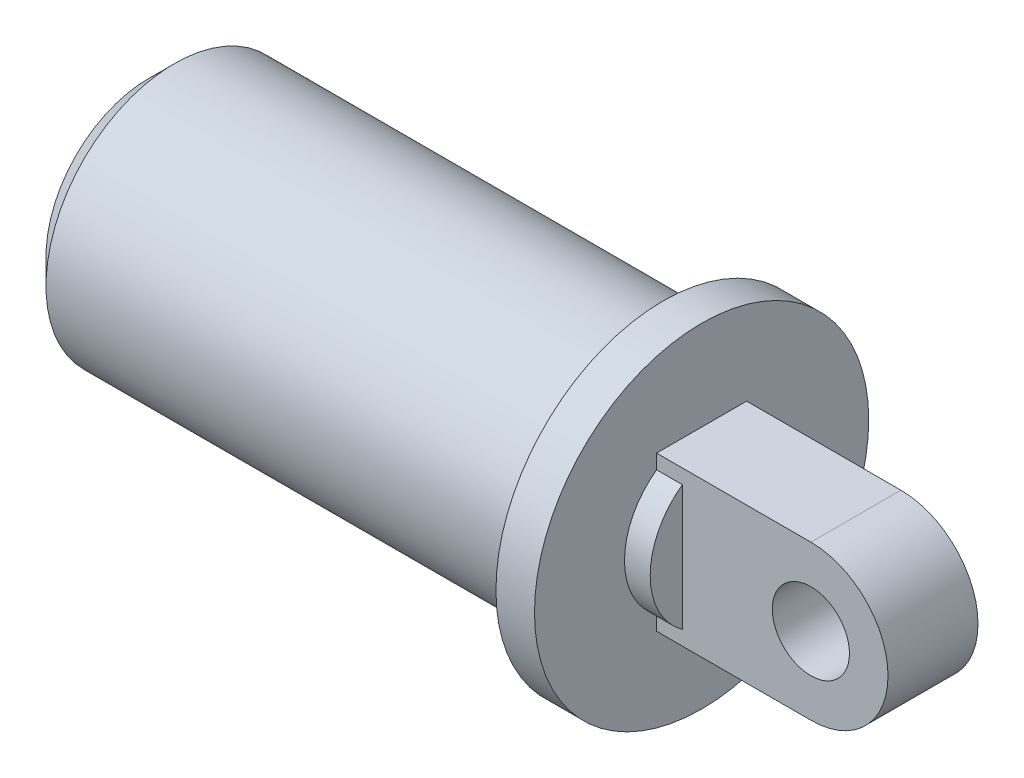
ISO-10303-21;
HEADER;
FILE_DESCRIPTION(('STEP AP214'),'2;1');
FILE_NAME('part.step','',(''),(''),'','','');
FILE_SCHEMA(('AUTOMOTIVE_DESIGN { 1 0 10303 214 1 1 1 1 }'));
ENDSEC;
DATA;
#1=APPLICATION_CONTEXT('core data for automotive mechanical design processes');
#2=APPLICATION_PROTOCOL_DEFINITION('international standard','automotive_design',2000,#1);
#3=PRODUCT_CONTEXT('',#1,'mechanical');
#4=PRODUCT('Part','Part','',(#3));
#5=PRODUCT_RELATED_PRODUCT_CATEGORY('part','',(#4));
#6=PRODUCT_DEFINITION_FORMATION('','',#4);
#7=PRODUCT_DEFINITION_CONTEXT('part definition',#1,'design');
#8=PRODUCT_DEFINITION('design','',#6,#7);
#9=PRODUCT_DEFINITION_SHAPE('','',#8);
#10=(LENGTH_UNIT() NAMED_UNIT(*) SI_UNIT(.MILLI.,.METRE.));
#11=(NAMED_UNIT(*) PLANE_ANGLE_UNIT() SI_UNIT($,.RADIAN.));
#12=(NAMED_UNIT(*) SI_UNIT($,.STERADIAN.) SOLID_ANGLE_UNIT());
#13=UNCERTAINTY_MEASURE_WITH_UNIT(LENGTH_MEASURE(1.E-05),#10,'distance_accuracy_value','');
#14=(GEOMETRIC_REPRESENTATION_CONTEXT(3) GLOBAL_UNCERTAINTY_ASSIGNED_CONTEXT((#13)) GLOBAL_UNIT_ASSIGNED_CONTEXT((#10,
#11,#12)) REPRESENTATION_CONTEXT('',''));
#15=CARTESIAN_POINT('',(0.,0.,0.));
#16=DIRECTION('',(0.,0.,1.));
#17=DIRECTION('',(1.,0.,0.));
#18=AXIS2_PLACEMENT_3D('',#15,#16,#17);
#19=CARTESIAN_POINT('',(0.,0.,-3.5));
#20=DIRECTION('',(0.,0.,1.));
#21=DIRECTION('',(1.,0.,0.));
#22=AXIS2_PLACEMENT_3D('',#19,#20,#21);
#23=CYLINDRICAL_SURFACE('',#22,3.);
#24=CARTESIAN_POINT('',(0.,0.,3.5));
#25=DIRECTION('',(0.,0.,1.));
#26=DIRECTION('',(1.,0.,0.));
#27=AXIS2_PLACEMENT_3D('',#24,#25,#26);
#28=CIRCLE('',#27,3.);
#29=CARTESIAN_POINT('',(3.,0.,3.5));
#30=VERTEX_POINT('',#29);
#31=EDGE_CURVE('E20',#30,#30,#28,.F.);
#32=ORIENTED_EDGE('',*,*,#31,.F.);
#33=EDGE_LOOP('',(#32));
#34=FACE_BOUND('',#33,.T.);
#35=CARTESIAN_POINT('',(0.,0.,-3.5));
#36=DIRECTION('',(0.,0.,1.));
#37=DIRECTION('',(1.,0.,0.));
#38=AXIS2_PLACEMENT_3D('',#35,#36,#37);
#39=CIRCLE('',#38,3.);
#40=CARTESIAN_POINT('',(3.,0.,-3.5));
#41=VERTEX_POINT('',#40);
#42=EDGE_CURVE('E155',#41,#41,#39,.F.);
#43=ORIENTED_EDGE('',*,*,#42,.T.);
#44=EDGE_LOOP('',(#43));
#45=FACE_BOUND('',#44,.T.);
#46=ADVANCED_FACE('F16',(#34,#45),#23,.F.);
#47=CARTESIAN_POINT('',(-25.,0.,0.));
#48=DIRECTION('',(1.,0.,0.));
#49=DIRECTION('',(0.,0.,-1.));
#50=AXIS2_PLACEMENT_3D('',#47,#48,#49);
#51=PLANE('',#50);
#52=CARTESIAN_POINT('',(-25.,0.,0.));
#53=DIRECTION('',(1.,0.,0.));
#54=DIRECTION('',(0.,0.,-1.));
#55=AXIS2_PLACEMENT_3D('',#52,#53,#54);
#56=CIRCLE('',#55,8.);
#57=CARTESIAN_POINT('',(-25.,0.,-8.));
#58=VERTEX_POINT('',#57);
#59=EDGE_CURVE('E103',#58,#58,#56,.F.);
#60=ORIENTED_EDGE('',*,*,#59,.T.);
#61=EDGE_LOOP('',(#60));
#62=FACE_BOUND('',#61,.T.);
#63=ADVANCED_FACE('F204',(#62),#51,.F.);
#64=CARTESIAN_POINT('',(-10.,0.,0.));
#65=DIRECTION('',(1.,0.,0.));
#66=DIRECTION('',(0.,0.,-1.));
#67=AXIS2_PLACEMENT_3D('',#64,#65,#66);
#68=PLANE('',#67);
#69=CARTESIAN_POINT('',(-10.,0.,0.));
#70=DIRECTION('',(1.,0.,0.));
#71=DIRECTION('',(0.,0.,-1.));
#72=AXIS2_PLACEMENT_3D('',#69,#70,#71);
#73=CIRCLE('',#72,6.);
#74=CARTESIAN_POINT('',(-10.,-4.8733971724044,3.50000000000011));
#75=VERTEX_POINT('',#74);
#76=CARTESIAN_POINT('',(-10.,4.8733971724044,3.50000000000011));
#77=VERTEX_POINT('',#76);
#78=EDGE_CURVE('E148',#75,#77,#73,.F.);
#79=ORIENTED_EDGE('',*,*,#78,.F.);
#80=DIRECTION('',(0.,1.,0.));
#81=VECTOR('',#80,1.);
#82=CARTESIAN_POINT('',(-10.,0.,3.5));
#83=LINE('',#82,#81);
#84=EDGE_CURVE('E106',#77,#75,#83,.F.);
#85=ORIENTED_EDGE('',*,*,#84,.F.);
#86=EDGE_LOOP('',(#79,#85));
#87=FACE_BOUND('',#86,.T.);
#88=ADVANCED_FACE('F231',(#87),#68,.T.);
#89=CARTESIAN_POINT('',(0.,0.,3.5));
#90=DIRECTION('',(0.,0.,1.));
#91=DIRECTION('',(1.,0.,0.));
#92=AXIS2_PLACEMENT_3D('',#89,#90,#91);
#93=PLANE('',#92);
#94=ORIENTED_EDGE('',*,*,#31,.T.);
#95=EDGE_LOOP('',(#94));
#96=FACE_BOUND('',#95,.T.);
#97=DIRECTION('',(1.,0.,0.));
#98=VECTOR('',#97,1.);
#99=CARTESIAN_POINT('',(-12.,4.87339717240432,3.50000000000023));
#100=LINE('',#99,#98);
#101=CARTESIAN_POINT('',(-12.,4.8733971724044,3.50000000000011));
#102=VERTEX_POINT('',#101);
#103=EDGE_CURVE('E97',#77,#102,#100,.F.);
#104=ORIENTED_EDGE('',*,*,#103,.F.);
#105=ORIENTED_EDGE('',*,*,#84,.T.);
#106=DIRECTION('',(1.,0.,0.));
#107=VECTOR('',#106,1.);
#108=CARTESIAN_POINT('',(-12.,-4.87339717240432,3.50000000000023));
#109=LINE('',#108,#107);
#110=CARTESIAN_POINT('',(-12.,-4.8733971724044,3.50000000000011));
#111=VERTEX_POINT('',#110);
#112=EDGE_CURVE('E152',#111,#75,#109,.T.);
#113=ORIENTED_EDGE('',*,*,#112,.F.);
#114=DIRECTION('',(0.,1.,0.));
#115=VECTOR('',#114,1.);
#116=CARTESIAN_POINT('',(-12.,0.,3.5));
#117=LINE('',#116,#115);
#118=CARTESIAN_POINT('',(-12.,-6.,3.5));
#119=VERTEX_POINT('',#118);
#120=EDGE_CURVE('E93',#111,#119,#117,.F.);
#121=ORIENTED_EDGE('',*,*,#120,.T.);
#122=DIRECTION('',(1.,0.,0.));
#123=VECTOR('',#122,1.);
#124=CARTESIAN_POINT('',(-12.,-6.,3.5));
#125=LINE('',#124,#123);
#126=CARTESIAN_POINT('',(0.,-6.,3.5));
#127=VERTEX_POINT('',#126);
#128=EDGE_CURVE('E88',#127,#119,#125,.F.);
#129=ORIENTED_EDGE('',*,*,#128,.F.);
#130=CARTESIAN_POINT('',(0.,0.,3.5));
#131=DIRECTION('',(0.,0.,1.));
#132=DIRECTION('',(1.,0.,0.));
#133=AXIS2_PLACEMENT_3D('',#130,#131,#132);
#134=CIRCLE('',#133,6.);
#135=CARTESIAN_POINT('',(0.,6.,3.5));
#136=VERTEX_POINT('',#135);
#137=EDGE_CURVE('E74',#136,#127,#134,.F.);
#138=ORIENTED_EDGE('',*,*,#137,.F.);
#139=DIRECTION('',(1.,0.,0.));
#140=VECTOR('',#139,1.);
#141=CARTESIAN_POINT('',(0.,6.,3.5));
#142=LINE('',#141,#140);
#143=CARTESIAN_POINT('',(-12.,6.,3.5));
#144=VERTEX_POINT('',#143);
#145=EDGE_CURVE('E151',#144,#136,#142,.T.);
#146=ORIENTED_EDGE('',*,*,#145,.F.);
#147=DIRECTION('',(0.,1.,0.));
#148=VECTOR('',#147,1.);
#149=CARTESIAN_POINT('',(-12.,0.,3.5));
#150=LINE('',#149,#148);
#151=EDGE_CURVE('E189',#144,#102,#150,.F.);
#152=ORIENTED_EDGE('',*,*,#151,.T.);
#153=EDGE_LOOP('',(#104,#105,#113,#121,#129,#138,#146,#152));
#154=FACE_BOUND('',#153,.T.);
#155=ADVANCED_FACE('F90',(#96,#154),#93,.T.);
#156=CARTESIAN_POINT('',(0.,0.,-3.5));
#157=DIRECTION('',(0.,0.,1.));
#158=DIRECTION('',(1.,0.,0.));
#159=AXIS2_PLACEMENT_3D('',#156,#157,#158);
#160=CYLINDRICAL_SURFACE('',#159,6.);
#161=DIRECTION('',(0.,0.,-1.));
#162=VECTOR('',#161,1.);
#163=CARTESIAN_POINT('',(0.,-6.,-3.5));
#164=LINE('',#163,#162);
#165=CARTESIAN_POINT('',(0.,-6.,-3.5));
#166=VERTEX_POINT('',#165);
#167=EDGE_CURVE('E78',#166,#127,#164,.F.);
#168=ORIENTED_EDGE('',*,*,#167,.F.);
#169=CARTESIAN_POINT('',(0.,0.,-3.5));
#170=DIRECTION('',(0.,0.,1.));
#171=DIRECTION('',(1.,0.,0.));
#172=AXIS2_PLACEMENT_3D('',#169,#170,#171);
#173=CIRCLE('',#172,6.);
#174=CARTESIAN_POINT('',(0.,6.,-3.5));
#175=VERTEX_POINT('',#174);
#176=EDGE_CURVE('E159',#166,#175,#173,.T.);
#177=ORIENTED_EDGE('',*,*,#176,.T.);
#178=DIRECTION('',(0.,0.,1.));
#179=VECTOR('',#178,1.);
#180=CARTESIAN_POINT('',(0.,6.,-3.5));
#181=LINE('',#180,#179);
#182=EDGE_CURVE('E81',#136,#175,#181,.F.);
#183=ORIENTED_EDGE('',*,*,#182,.F.);
#184=ORIENTED_EDGE('',*,*,#137,.T.);
#185=EDGE_LOOP('',(#168,#177,#183,#184));
#186=FACE_BOUND('',#185,.T.);
#187=ADVANCED_FACE('F76',(#186),#160,.T.);
#188=CARTESIAN_POINT('',(-10.,0.,0.));
#189=DIRECTION('',(1.,0.,0.));
#190=DIRECTION('',(0.,0.,-1.));
#191=AXIS2_PLACEMENT_3D('',#188,#189,#190);
#192=PLANE('',#191);
#193=CARTESIAN_POINT('',(-10.,0.,0.));
#194=DIRECTION('',(1.,0.,0.));
#195=DIRECTION('',(0.,0.,-1.));
#196=AXIS2_PLACEMENT_3D('',#193,#194,#195);
#197=CIRCLE('',#196,6.);
#198=CARTESIAN_POINT('',(-10.,4.8733971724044,-3.50000000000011));
#199=VERTEX_POINT('',#198);
#200=CARTESIAN_POINT('',(-10.,-4.8733971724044,-3.50000000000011));
#201=VERTEX_POINT('',#200);
#202=EDGE_CURVE('E144',#199,#201,#197,.F.);
#203=ORIENTED_EDGE('',*,*,#202,.F.);
#204=DIRECTION('',(0.,1.,0.));
#205=VECTOR('',#204,1.);
#206=CARTESIAN_POINT('',(-10.,0.,-3.5));
#207=LINE('',#206,#205);
#208=EDGE_CURVE('E85',#199,#201,#207,.F.);
#209=ORIENTED_EDGE('',*,*,#208,.T.);
#210=EDGE_LOOP('',(#203,#209));
#211=FACE_BOUND('',#210,.T.);
#212=ADVANCED_FACE('F212',(#211),#192,.T.);
#213=CARTESIAN_POINT('',(0.,0.,-3.5));
#214=DIRECTION('',(0.,0.,1.));
#215=DIRECTION('',(1.,0.,0.));
#216=AXIS2_PLACEMENT_3D('',#213,#214,#215);
#217=PLANE('',#216);
#218=ORIENTED_EDGE('',*,*,#42,.F.);
#219=EDGE_LOOP('',(#218));
#220=FACE_BOUND('',#219,.T.);
#221=DIRECTION('',(0.,1.,0.));
#222=VECTOR('',#221,1.);
#223=CARTESIAN_POINT('',(-12.,0.,-3.5));
#224=LINE('',#223,#222);
#225=CARTESIAN_POINT('',(-12.,6.,-3.5));
#226=VERTEX_POINT('',#225);
#227=CARTESIAN_POINT('',(-12.,4.8733971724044,-3.50000000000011));
#228=VERTEX_POINT('',#227);
#229=EDGE_CURVE('E158',#226,#228,#224,.F.);
#230=ORIENTED_EDGE('',*,*,#229,.F.);
#231=DIRECTION('',(1.,0.,0.));
#232=VECTOR('',#231,1.);
#233=CARTESIAN_POINT('',(0.,6.,-3.5));
#234=LINE('',#233,#232);
#235=EDGE_CURVE('E177',#175,#226,#234,.F.);
#236=ORIENTED_EDGE('',*,*,#235,.F.);
#237=ORIENTED_EDGE('',*,*,#176,.F.);
#238=DIRECTION('',(1.,0.,0.));
#239=VECTOR('',#238,1.);
#240=CARTESIAN_POINT('',(-12.,-6.,-3.5));
#241=LINE('',#240,#239);
#242=CARTESIAN_POINT('',(-12.,-6.,-3.5));
#243=VERTEX_POINT('',#242);
#244=EDGE_CURVE('E101',#243,#166,#241,.T.);
#245=ORIENTED_EDGE('',*,*,#244,.F.);
#246=DIRECTION('',(0.,1.,0.));
#247=VECTOR('',#246,1.);
#248=CARTESIAN_POINT('',(-12.,0.,-3.5));
#249=LINE('',#248,#247);
#250=CARTESIAN_POINT('',(-12.,-4.8733971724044,-3.50000000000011));
#251=VERTEX_POINT('',#250);
#252=EDGE_CURVE('E160',#251,#243,#249,.F.);
#253=ORIENTED_EDGE('',*,*,#252,.F.);
#254=DIRECTION('',(1.,0.,0.));
#255=VECTOR('',#254,1.);
#256=CARTESIAN_POINT('',(-12.,-4.87339717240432,-3.50000000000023));
#257=LINE('',#256,#255);
#258=EDGE_CURVE('E143',#201,#251,#257,.F.);
#259=ORIENTED_EDGE('',*,*,#258,.F.);
#260=ORIENTED_EDGE('',*,*,#208,.F.);
#261=DIRECTION('',(1.,0.,0.));
#262=VECTOR('',#261,1.);
#263=CARTESIAN_POINT('',(-12.,4.87339717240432,-3.50000000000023));
#264=LINE('',#263,#262);
#265=EDGE_CURVE('E147',#228,#199,#264,.T.);
#266=ORIENTED_EDGE('',*,*,#265,.F.);
#267=EDGE_LOOP('',(#230,#236,#237,#245,#253,#259,#260,#266));
#268=FACE_BOUND('',#267,.T.);
#269=ADVANCED_FACE('F208',(#220,#268),#217,.F.);
#270=CARTESIAN_POINT('',(-25.,0.,0.));
#271=DIRECTION('',(1.,0.,0.));
#272=DIRECTION('',(0.,0.,-1.));
#273=AXIS2_PLACEMENT_3D('',#270,#271,#272);
#274=CYLINDRICAL_SURFACE('',#273,8.);
#275=CARTESIAN_POINT('',(-43.5,0.,0.));
#276=DIRECTION('',(1.,0.,0.));
#277=DIRECTION('',(0.,0.,-1.));
#278=AXIS2_PLACEMENT_3D('',#275,#276,#277);
#279=CIRCLE('',#278,8.);
#280=CARTESIAN_POINT('',(-43.5,0.,-8.));
#281=VERTEX_POINT('',#280);
#282=EDGE_CURVE('E114',#281,#281,#279,.T.);
#283=ORIENTED_EDGE('',*,*,#282,.F.);
#284=EDGE_LOOP('',(#283));
#285=FACE_BOUND('',#284,.T.);
#286=ORIENTED_EDGE('',*,*,#59,.F.);
#287=EDGE_LOOP('',(#286));
#288=FACE_BOUND('',#287,.T.);
#289=ADVANCED_FACE('F211',(#285,#288),#274,.F.);
#290=CARTESIAN_POINT('',(-12.,-6.,-3.5));
#291=DIRECTION('',(0.,-1.,0.));
#292=DIRECTION('',(0.,0.,-1.));
#293=AXIS2_PLACEMENT_3D('',#290,#291,#292);
#294=PLANE('',#293);
#295=ORIENTED_EDGE('',*,*,#128,.T.);
#296=DIRECTION('',(0.,0.,-1.));
#297=VECTOR('',#296,1.);
#298=CARTESIAN_POINT('',(-12.,-6.,0.));
#299=LINE('',#298,#297);
#300=EDGE_CURVE('E111',#243,#119,#299,.F.);
#301=ORIENTED_EDGE('',*,*,#300,.F.);
#302=ORIENTED_EDGE('',*,*,#244,.T.);
#303=ORIENTED_EDGE('',*,*,#167,.T.);
#304=EDGE_LOOP('',(#295,#301,#302,#303));
#305=FACE_BOUND('',#304,.T.);
#306=ADVANCED_FACE('F99',(#305),#294,.T.);
#307=CARTESIAN_POINT('',(-12.,0.,0.));
#308=DIRECTION('',(1.,0.,0.));
#309=DIRECTION('',(0.,0.,-1.));
#310=AXIS2_PLACEMENT_3D('',#307,#308,#309);
#311=CYLINDRICAL_SURFACE('',#310,6.);
#312=ORIENTED_EDGE('',*,*,#112,.T.);
#313=ORIENTED_EDGE('',*,*,#78,.T.);
#314=ORIENTED_EDGE('',*,*,#103,.T.);
#315=CARTESIAN_POINT('',(-12.,0.,0.));
#316=DIRECTION('',(1.,0.,0.));
#317=DIRECTION('',(0.,0.,-1.));
#318=AXIS2_PLACEMENT_3D('',#315,#316,#317);
#319=CIRCLE('',#318,6.);
#320=EDGE_CURVE('E113',#111,#102,#319,.F.);
#321=ORIENTED_EDGE('',*,*,#320,.F.);
#322=EDGE_LOOP('',(#312,#313,#314,#321));
#323=FACE_BOUND('',#322,.T.);
#324=ADVANCED_FACE('F229',(#323),#311,.T.);
#325=CARTESIAN_POINT('',(0.,6.,-3.5));
#326=DIRECTION('',(0.,1.,0.));
#327=DIRECTION('',(0.,0.,1.));
#328=AXIS2_PLACEMENT_3D('',#325,#326,#327);
#329=PLANE('',#328);
#330=ORIENTED_EDGE('',*,*,#235,.T.);
#331=DIRECTION('',(0.,0.,-1.));
#332=VECTOR('',#331,1.);
#333=CARTESIAN_POINT('',(-12.,6.,0.));
#334=LINE('',#333,#332);
#335=EDGE_CURVE('E138',#144,#226,#334,.T.);
#336=ORIENTED_EDGE('',*,*,#335,.F.);
#337=ORIENTED_EDGE('',*,*,#145,.T.);
#338=ORIENTED_EDGE('',*,*,#182,.T.);
#339=EDGE_LOOP('',(#330,#336,#337,#338));
#340=FACE_BOUND('',#339,.T.);
#341=ADVANCED_FACE('F218',(#340),#329,.T.);
#342=CARTESIAN_POINT('',(-12.,0.,0.));
#343=DIRECTION('',(1.,0.,0.));
#344=DIRECTION('',(0.,0.,-1.));
#345=AXIS2_PLACEMENT_3D('',#342,#343,#344);
#346=CYLINDRICAL_SURFACE('',#345,6.);
#347=CARTESIAN_POINT('',(-12.,0.,0.));
#348=DIRECTION('',(1.,0.,0.));
#349=DIRECTION('',(0.,0.,-1.));
#350=AXIS2_PLACEMENT_3D('',#347,#348,#349);
#351=CIRCLE('',#350,6.);
#352=EDGE_CURVE('E35',#228,#251,#351,.F.);
#353=ORIENTED_EDGE('',*,*,#352,.F.);
#354=ORIENTED_EDGE('',*,*,#265,.T.);
#355=ORIENTED_EDGE('',*,*,#202,.T.);
#356=ORIENTED_EDGE('',*,*,#258,.T.);
#357=EDGE_LOOP('',(#353,#354,#355,#356));
#358=FACE_BOUND('',#357,.T.);
#359=ADVANCED_FACE('F224',(#358),#346,.T.);
#360=CARTESIAN_POINT('',(-43.5,0.,0.));
#361=DIRECTION('',(1.,0.,0.));
#362=DIRECTION('',(0.,0.,-1.));
#363=AXIS2_PLACEMENT_3D('',#360,#361,#362);
#364=PLANE('',#363);
#365=CARTESIAN_POINT('',(-43.5,0.,0.));
#366=DIRECTION('',(-1.,0.,0.));
#367=DIRECTION('',(0.,0.,1.));
#368=AXIS2_PLACEMENT_3D('',#365,#366,#367);
#369=CIRCLE('',#368,2.);
#370=CARTESIAN_POINT('',(-43.5,0.,2.));
#371=VERTEX_POINT('',#370);
#372=EDGE_CURVE('E134',#371,#371,#369,.T.);
#373=ORIENTED_EDGE('',*,*,#372,.T.);
#374=EDGE_LOOP('',(#373));
#375=FACE_BOUND('',#374,.T.);
#376=ORIENTED_EDGE('',*,*,#282,.T.);
#377=EDGE_LOOP('',(#376));
#378=FACE_BOUND('',#377,.T.);
#379=ADVANCED_FACE('F318',(#375,#378),#364,.T.);
#380=CARTESIAN_POINT('',(-12.,0.,0.));
#381=DIRECTION('',(1.,0.,0.));
#382=DIRECTION('',(0.,0.,-1.));
#383=AXIS2_PLACEMENT_3D('',#380,#381,#382);
#384=PLANE('',#383);
#385=ORIENTED_EDGE('',*,*,#229,.T.);
#386=ORIENTED_EDGE('',*,*,#352,.T.);
#387=ORIENTED_EDGE('',*,*,#252,.T.);
#388=ORIENTED_EDGE('',*,*,#300,.T.);
#389=ORIENTED_EDGE('',*,*,#120,.F.);
#390=ORIENTED_EDGE('',*,*,#320,.T.);
#391=ORIENTED_EDGE('',*,*,#151,.F.);
#392=ORIENTED_EDGE('',*,*,#335,.T.);
#393=EDGE_LOOP('',(#385,#386,#387,#388,#389,#390,#391,#392));
#394=FACE_BOUND('',#393,.T.);
#395=CARTESIAN_POINT('',(-12.,0.,0.));
#396=DIRECTION('',(1.,0.,0.));
#397=DIRECTION('',(0.,0.,-1.));
#398=AXIS2_PLACEMENT_3D('',#395,#396,#397);
#399=CIRCLE('',#398,13.);
#400=CARTESIAN_POINT('',(-12.,0.,-13.));
#401=VERTEX_POINT('',#400);
#402=EDGE_CURVE('E131',#401,#401,#399,.F.);
#403=ORIENTED_EDGE('',*,*,#402,.F.);
#404=EDGE_LOOP('',(#403));
#405=FACE_BOUND('',#404,.T.);
#406=ADVANCED_FACE('F219',(#394,#405),#384,.T.);
#407=CARTESIAN_POINT('',(-55.,0.,0.));
#408=DIRECTION('',(-1.,0.,0.));
#409=DIRECTION('',(0.,0.,1.));
#410=AXIS2_PLACEMENT_3D('',#407,#408,#409);
#411=CYLINDRICAL_SURFACE('',#410,2.);
#412=ORIENTED_EDGE('',*,*,#372,.F.);
#413=EDGE_LOOP('',(#412));
#414=FACE_BOUND('',#413,.T.);
#415=CARTESIAN_POINT('',(-55.,0.,0.));
#416=DIRECTION('',(-1.,0.,0.));
#417=DIRECTION('',(0.,0.,1.));
#418=AXIS2_PLACEMENT_3D('',#415,#416,#417);
#419=CIRCLE('',#418,2.);
#420=CARTESIAN_POINT('',(-55.,0.,2.));
#421=VERTEX_POINT('',#420);
#422=EDGE_CURVE('E128',#421,#421,#419,.T.);
#423=ORIENTED_EDGE('',*,*,#422,.T.);
#424=EDGE_LOOP('',(#423));
#425=FACE_BOUND('',#424,.T.);
#426=ADVANCED_FACE('F266',(#414,#425),#411,.F.);
#427=CARTESIAN_POINT('',(-15.,0.,0.));
#428=DIRECTION('',(1.,0.,0.));
#429=DIRECTION('',(0.,0.,-1.));
#430=AXIS2_PLACEMENT_3D('',#427,#428,#429);
#431=CYLINDRICAL_SURFACE('',#430,13.);
#432=ORIENTED_EDGE('',*,*,#402,.T.);
#433=EDGE_LOOP('',(#432));
#434=FACE_BOUND('',#433,.T.);
#435=CARTESIAN_POINT('',(-15.,0.,0.));
#436=DIRECTION('',(1.,0.,0.));
#437=DIRECTION('',(0.,0.,-1.));
#438=AXIS2_PLACEMENT_3D('',#435,#436,#437);
#439=CIRCLE('',#438,13.);
#440=CARTESIAN_POINT('',(-15.,0.,-13.));
#441=VERTEX_POINT('',#440);
#442=EDGE_CURVE('E125',#441,#441,#439,.T.);
#443=ORIENTED_EDGE('',*,*,#442,.T.);
#444=EDGE_LOOP('',(#443));
#445=FACE_BOUND('',#444,.T.);
#446=ADVANCED_FACE('F264',(#434,#445),#431,.T.);
#447=CARTESIAN_POINT('',(-55.,0.,0.));
#448=DIRECTION('',(1.,0.,0.));
#449=DIRECTION('',(0.,0.,-1.));
#450=AXIS2_PLACEMENT_3D('',#447,#448,#449);
#451=PLANE('',#450);
#452=ORIENTED_EDGE('',*,*,#422,.F.);
#453=EDGE_LOOP('',(#452));
#454=FACE_BOUND('',#453,.T.);
#455=CARTESIAN_POINT('',(-55.,0.,0.));
#456=DIRECTION('',(1.,0.,0.));
#457=DIRECTION('',(0.,0.,-1.));
#458=AXIS2_PLACEMENT_3D('',#455,#456,#457);
#459=CIRCLE('',#458,8.00000146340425);
#460=CARTESIAN_POINT('',(-55.,0.,-8.00000146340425));
#461=VERTEX_POINT('',#460);
#462=EDGE_CURVE('E122',#461,#461,#459,.T.);
#463=ORIENTED_EDGE('',*,*,#462,.F.);
#464=EDGE_LOOP('',(#463));
#465=FACE_BOUND('',#464,.T.);
#466=ADVANCED_FACE('F260',(#454,#465),#451,.F.);
#467=CARTESIAN_POINT('',(-15.,0.,0.));
#468=DIRECTION('',(1.,0.,0.));
#469=DIRECTION('',(0.,0.,-1.));
#470=AXIS2_PLACEMENT_3D('',#467,#468,#469);
#471=PLANE('',#470);
#472=CARTESIAN_POINT('',(-14.9999999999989,0.,0.));
#473=DIRECTION('',(-1.,0.,0.));
#474=DIRECTION('',(0.,0.,1.));
#475=AXIS2_PLACEMENT_3D('',#472,#473,#474);
#476=CIRCLE('',#475,8.00000146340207);
#477=CARTESIAN_POINT('',(-14.9999999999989,0.,8.00000146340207));
#478=VERTEX_POINT('',#477);
#479=EDGE_CURVE('E119',#478,#478,#476,.T.);
#480=ORIENTED_EDGE('',*,*,#479,.F.);
#481=EDGE_LOOP('',(#480));
#482=FACE_BOUND('',#481,.T.);
#483=ORIENTED_EDGE('',*,*,#442,.F.);
#484=EDGE_LOOP('',(#483));
#485=FACE_BOUND('',#484,.T.);
#486=ADVANCED_FACE('F257',(#482,#485),#471,.F.);
#487=CARTESIAN_POINT('',(-53.0000002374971,0.,0.));
#488=DIRECTION('',(1.,0.,0.));
#489=DIRECTION('',(0.,1.,0.));
#490=AXIS2_PLACEMENT_3D('',#487,#488,#489);
#491=CONICAL_SURFACE('',#490,10.0000015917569,0.785398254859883);
#492=CARTESIAN_POINT('',(-53.0000002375,0.,0.));
#493=DIRECTION('',(1.,0.,0.));
#494=DIRECTION('',(0.,0.,-1.));
#495=AXIS2_PLACEMENT_3D('',#492,#493,#494);
#496=CIRCLE('',#495,10.);
#497=CARTESIAN_POINT('',(-53.0000002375,0.,-10.));
#498=VERTEX_POINT('',#497);
#499=EDGE_CURVE('E26',#498,#498,#496,.T.);
#500=ORIENTED_EDGE('',*,*,#499,.F.);
#501=EDGE_LOOP('',(#500));
#502=FACE_BOUND('',#501,.T.);
#503=ORIENTED_EDGE('',*,*,#462,.T.);
#504=EDGE_LOOP('',(#503));
#505=FACE_BOUND('',#504,.T.);
#506=ADVANCED_FACE('F248',(#502,#505),#491,.T.);
#507=CARTESIAN_POINT('',(-16.9999997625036,0.,0.));
#508=DIRECTION('',(-1.,0.,0.));
#509=DIRECTION('',(0.,0.,1.));
#510=AXIS2_PLACEMENT_3D('',#507,#508,#509);
#511=CONICAL_SURFACE('',#510,10.0000015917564,0.785398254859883);
#512=CARTESIAN_POINT('',(-16.9999997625,0.,0.));
#513=DIRECTION('',(1.,0.,0.));
#514=DIRECTION('',(0.,0.,-1.));
#515=AXIS2_PLACEMENT_3D('',#512,#513,#514);
#516=CIRCLE('',#515,10.);
#517=CARTESIAN_POINT('',(-16.9999997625,0.,-10.));
#518=VERTEX_POINT('',#517);
#519=EDGE_CURVE('E11',#518,#518,#516,.F.);
#520=ORIENTED_EDGE('',*,*,#519,.F.);
#521=EDGE_LOOP('',(#520));
#522=FACE_BOUND('',#521,.T.);
#523=ORIENTED_EDGE('',*,*,#479,.T.);
#524=EDGE_LOOP('',(#523));
#525=FACE_BOUND('',#524,.T.);
#526=ADVANCED_FACE('F243',(#522,#525),#511,.T.);
#527=CARTESIAN_POINT('',(-15.,0.,0.));
#528=DIRECTION('',(1.,0.,0.));
#529=DIRECTION('',(0.,0.,-1.));
#530=AXIS2_PLACEMENT_3D('',#527,#528,#529);
#531=CYLINDRICAL_SURFACE('',#530,10.);
#532=ORIENTED_EDGE('',*,*,#499,.T.);
#533=EDGE_LOOP('',(#532));
#534=FACE_BOUND('',#533,.T.);
#535=ORIENTED_EDGE('',*,*,#519,.T.);
#536=EDGE_LOOP('',(#535));
#537=FACE_BOUND('',#536,.T.);
#538=ADVANCED_FACE('F18',(#534,#537),#531,.T.);
#539=CLOSED_SHELL('',(#46,#63,#88,#155,#187,#212,#269,#289,#306,#324,#341,#359,#379,#406,#426,
#446,#466,#486,#506,#526,#538));
#540=MANIFOLD_SOLID_BREP('B1',#539);
#541=ADVANCED_BREP_SHAPE_REPRESENTATION('',(#18,#540),#14);
#542=SHAPE_DEFINITION_REPRESENTATION(#9,#541);
ENDSEC;
END-ISO-10303-21;
